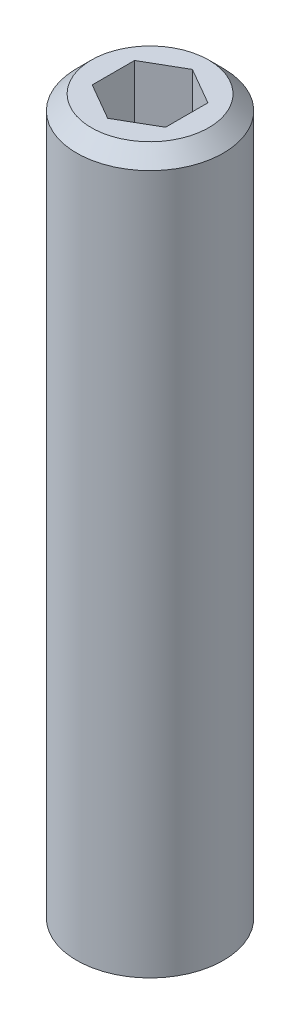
ISO-10303-21;
HEADER;
FILE_DESCRIPTION(('STEP AP214'),'2;1');
FILE_NAME('part.step','',(''),(''),'','','');
FILE_SCHEMA(('AUTOMOTIVE_DESIGN { 1 0 10303 214 1 1 1 1 }'));
ENDSEC;
DATA;
#1=APPLICATION_CONTEXT('core data for automotive mechanical design processes');
#2=APPLICATION_PROTOCOL_DEFINITION('international standard','automotive_design',2000,#1);
#3=PRODUCT_CONTEXT('',#1,'mechanical');
#4=PRODUCT('Part','Part','',(#3));
#5=PRODUCT_RELATED_PRODUCT_CATEGORY('part','',(#4));
#6=PRODUCT_DEFINITION_FORMATION('','',#4);
#7=PRODUCT_DEFINITION_CONTEXT('part definition',#1,'design');
#8=PRODUCT_DEFINITION('design','',#6,#7);
#9=PRODUCT_DEFINITION_SHAPE('','',#8);
#10=(LENGTH_UNIT() NAMED_UNIT(*) SI_UNIT(.MILLI.,.METRE.));
#11=(NAMED_UNIT(*) PLANE_ANGLE_UNIT() SI_UNIT($,.RADIAN.));
#12=(NAMED_UNIT(*) SI_UNIT($,.STERADIAN.) SOLID_ANGLE_UNIT());
#13=UNCERTAINTY_MEASURE_WITH_UNIT(LENGTH_MEASURE(1.E-05),#10,'distance_accuracy_value','');
#14=(GEOMETRIC_REPRESENTATION_CONTEXT(3) GLOBAL_UNCERTAINTY_ASSIGNED_CONTEXT((#13)) GLOBAL_UNIT_ASSIGNED_CONTEXT((#10,
#11,#12)) REPRESENTATION_CONTEXT('',''));
#15=CARTESIAN_POINT('',(0.,0.,0.));
#16=DIRECTION('',(0.,0.,1.));
#17=DIRECTION('',(1.,0.,0.));
#18=AXIS2_PLACEMENT_3D('',#15,#16,#17);
#19=CARTESIAN_POINT('',(0.,0.,0.));
#20=DIRECTION('',(0.,1.,0.));
#21=DIRECTION('',(0.,0.,1.));
#22=AXIS2_PLACEMENT_3D('',#19,#20,#21);
#23=CYLINDRICAL_SURFACE('',#22,2.);
#24=CARTESIAN_POINT('',(0.,-19.4651016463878,0.));
#25=DIRECTION('',(0.,-1.,0.));
#26=DIRECTION('',(0.,0.,-1.));
#27=AXIS2_PLACEMENT_3D('',#24,#25,#26);
#28=CIRCLE('',#27,2.);
#29=CARTESIAN_POINT('',(0.,-19.4651016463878,-2.));
#30=VERTEX_POINT('',#29);
#31=EDGE_CURVE('E471',#30,#30,#28,.T.);
#32=ORIENTED_EDGE('',*,*,#31,.F.);
#33=EDGE_LOOP('',(#32));
#34=FACE_BOUND('',#33,.T.);
#35=CARTESIAN_POINT('',(0.,-0.400000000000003,0.));
#36=DIRECTION('',(0.,-1.,0.));
#37=DIRECTION('',(0.,0.,-1.));
#38=AXIS2_PLACEMENT_3D('',#35,#36,#37);
#39=CIRCLE('',#38,2.);
#40=CARTESIAN_POINT('',(0.,-0.400000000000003,-2.));
#41=VERTEX_POINT('',#40);
#42=EDGE_CURVE('E11',#41,#41,#39,.T.);
#43=ORIENTED_EDGE('',*,*,#42,.T.);
#44=EDGE_LOOP('',(#43));
#45=FACE_BOUND('',#44,.T.);
#46=ADVANCED_FACE('F368',(#34,#45),#23,.T.);
#47=CARTESIAN_POINT('',(0.,0.,0.));
#48=DIRECTION('',(0.,-1.,0.));
#49=DIRECTION('',(0.,0.,-1.));
#50=AXIS2_PLACEMENT_3D('',#47,#48,#49);
#51=PLANE('',#50);
#52=DIRECTION('',(0.,0.,-1.));
#53=VECTOR('',#52,1.);
#54=CARTESIAN_POINT('',(1.,0.,0.577350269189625));
#55=LINE('',#54,#53);
#56=CARTESIAN_POINT('',(1.,0.,0.577350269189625));
#57=VERTEX_POINT('',#56);
#58=CARTESIAN_POINT('',(1.,0.,-0.577350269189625));
#59=VERTEX_POINT('',#58);
#60=EDGE_CURVE('E437',#57,#59,#55,.T.);
#61=ORIENTED_EDGE('',*,*,#60,.F.);
#62=DIRECTION('',(0.866025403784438,0.,-0.500000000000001));
#63=VECTOR('',#62,1.);
#64=CARTESIAN_POINT('',(0.,0.,1.15470053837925));
#65=LINE('',#64,#63);
#66=CARTESIAN_POINT('',(0.,0.,1.15470053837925));
#67=VERTEX_POINT('',#66);
#68=EDGE_CURVE('E383',#67,#57,#65,.T.);
#69=ORIENTED_EDGE('',*,*,#68,.F.);
#70=DIRECTION('',(0.866025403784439,0.,0.5));
#71=VECTOR('',#70,1.);
#72=CARTESIAN_POINT('',(-0.999999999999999,0.,0.577350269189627));
#73=LINE('',#72,#71);
#74=CARTESIAN_POINT('',(-0.999999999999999,0.,0.577350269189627));
#75=VERTEX_POINT('',#74);
#76=EDGE_CURVE('E453',#75,#67,#73,.T.);
#77=ORIENTED_EDGE('',*,*,#76,.F.);
#78=DIRECTION('',(0.,0.,1.));
#79=VECTOR('',#78,1.);
#80=CARTESIAN_POINT('',(-0.999999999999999,0.,-0.577350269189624));
#81=LINE('',#80,#79);
#82=CARTESIAN_POINT('',(-0.999999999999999,0.,-0.577350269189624));
#83=VERTEX_POINT('',#82);
#84=EDGE_CURVE('E447',#83,#75,#81,.T.);
#85=ORIENTED_EDGE('',*,*,#84,.F.);
#86=DIRECTION('',(-0.866025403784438,0.,0.500000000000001));
#87=VECTOR('',#86,1.);
#88=CARTESIAN_POINT('',(0.,0.,-1.15470053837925));
#89=LINE('',#88,#87);
#90=CARTESIAN_POINT('',(0.,0.,-1.15470053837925));
#91=VERTEX_POINT('',#90);
#92=EDGE_CURVE('E445',#91,#83,#89,.T.);
#93=ORIENTED_EDGE('',*,*,#92,.F.);
#94=DIRECTION('',(-0.866025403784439,0.,-0.5));
#95=VECTOR('',#94,1.);
#96=CARTESIAN_POINT('',(1.,0.,-0.577350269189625));
#97=LINE('',#96,#95);
#98=EDGE_CURVE('E426',#59,#91,#97,.T.);
#99=ORIENTED_EDGE('',*,*,#98,.F.);
#100=EDGE_LOOP('',(#61,#69,#77,#85,#93,#99));
#101=FACE_BOUND('',#100,.T.);
#102=CARTESIAN_POINT('',(0.,0.,0.));
#103=DIRECTION('',(0.,-1.,0.));
#104=DIRECTION('',(0.,0.,-1.));
#105=AXIS2_PLACEMENT_3D('',#102,#103,#104);
#106=CIRCLE('',#105,1.6);
#107=CARTESIAN_POINT('',(0.,0.,-1.6));
#108=VERTEX_POINT('',#107);
#109=EDGE_CURVE('E376',#108,#108,#106,.F.);
#110=ORIENTED_EDGE('',*,*,#109,.T.);
#111=EDGE_LOOP('',(#110));
#112=FACE_BOUND('',#111,.T.);
#113=ADVANCED_FACE('F441',(#101,#112),#51,.F.);
#114=CARTESIAN_POINT('',(0.,0.,0.));
#115=DIRECTION('',(0.,-1.,0.));
#116=DIRECTION('',(0.,0.,-1.));
#117=AXIS2_PLACEMENT_3D('',#114,#115,#116);
#118=CONICAL_SURFACE('',#117,1.6,0.785398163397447);
#119=CARTESIAN_POINT('',(0.,-0.400000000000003,-2.));
#120=CARTESIAN_POINT('',(0.,-0.395833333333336,-1.99583333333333));
#121=CARTESIAN_POINT('',(0.,-0.391666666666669,-1.99166666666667));
#122=CARTESIAN_POINT('',(0.,-0.383333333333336,-1.98333333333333));
#123=CARTESIAN_POINT('',(0.,-0.379166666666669,-1.97916666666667));
#124=CARTESIAN_POINT('',(0.,-0.370833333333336,-1.97083333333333));
#125=CARTESIAN_POINT('',(0.,-0.366666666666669,-1.96666666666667));
#126=CARTESIAN_POINT('',(0.,-0.358333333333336,-1.95833333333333));
#127=CARTESIAN_POINT('',(0.,-0.354166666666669,-1.95416666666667));
#128=CARTESIAN_POINT('',(0.,-0.345833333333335,-1.94583333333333));
#129=CARTESIAN_POINT('',(0.,-0.341666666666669,-1.94166666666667));
#130=CARTESIAN_POINT('',(0.,-0.333333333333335,-1.93333333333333));
#131=CARTESIAN_POINT('',(0.,-0.329166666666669,-1.92916666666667));
#132=CARTESIAN_POINT('',(0.,-0.320833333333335,-1.92083333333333));
#133=CARTESIAN_POINT('',(0.,-0.316666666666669,-1.91666666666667));
#134=CARTESIAN_POINT('',(0.,-0.308333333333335,-1.90833333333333));
#135=CARTESIAN_POINT('',(0.,-0.304166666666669,-1.90416666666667));
#136=CARTESIAN_POINT('',(0.,-0.295833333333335,-1.89583333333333));
#137=CARTESIAN_POINT('',(0.,-0.291666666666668,-1.89166666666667));
#138=CARTESIAN_POINT('',(0.,-0.283333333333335,-1.88333333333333));
#139=CARTESIAN_POINT('',(0.,-0.279166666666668,-1.87916666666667));
#140=CARTESIAN_POINT('',(0.,-0.270833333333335,-1.87083333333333));
#141=CARTESIAN_POINT('',(0.,-0.266666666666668,-1.86666666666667));
#142=CARTESIAN_POINT('',(0.,-0.258333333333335,-1.85833333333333));
#143=CARTESIAN_POINT('',(0.,-0.254166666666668,-1.85416666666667));
#144=CARTESIAN_POINT('',(0.,-0.245833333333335,-1.84583333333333));
#145=CARTESIAN_POINT('',(0.,-0.241666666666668,-1.84166666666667));
#146=CARTESIAN_POINT('',(0.,-0.233333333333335,-1.83333333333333));
#147=CARTESIAN_POINT('',(0.,-0.229166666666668,-1.82916666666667));
#148=CARTESIAN_POINT('',(0.,-0.220833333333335,-1.82083333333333));
#149=CARTESIAN_POINT('',(0.,-0.216666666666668,-1.81666666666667));
#150=CARTESIAN_POINT('',(0.,-0.208333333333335,-1.80833333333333));
#151=CARTESIAN_POINT('',(0.,-0.204166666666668,-1.80416666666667));
#152=CARTESIAN_POINT('',(0.,-0.195833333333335,-1.79583333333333));
#153=CARTESIAN_POINT('',(0.,-0.191666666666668,-1.79166666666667));
#154=CARTESIAN_POINT('',(0.,-0.183333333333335,-1.78333333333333));
#155=CARTESIAN_POINT('',(0.,-0.179166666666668,-1.77916666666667));
#156=CARTESIAN_POINT('',(0.,-0.170833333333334,-1.77083333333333));
#157=CARTESIAN_POINT('',(0.,-0.166666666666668,-1.76666666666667));
#158=CARTESIAN_POINT('',(0.,-0.158333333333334,-1.75833333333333));
#159=CARTESIAN_POINT('',(0.,-0.154166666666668,-1.75416666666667));
#160=CARTESIAN_POINT('',(0.,-0.145833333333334,-1.74583333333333));
#161=CARTESIAN_POINT('',(0.,-0.141666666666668,-1.74166666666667));
#162=CARTESIAN_POINT('',(0.,-0.133333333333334,-1.73333333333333));
#163=CARTESIAN_POINT('',(0.,-0.129166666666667,-1.72916666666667));
#164=CARTESIAN_POINT('',(0.,-0.120833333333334,-1.72083333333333));
#165=CARTESIAN_POINT('',(0.,-0.116666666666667,-1.71666666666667));
#166=CARTESIAN_POINT('',(0.,-0.108333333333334,-1.70833333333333));
#167=CARTESIAN_POINT('',(0.,-0.104166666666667,-1.70416666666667));
#168=CARTESIAN_POINT('',(0.,-0.0958333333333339,-1.69583333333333));
#169=CARTESIAN_POINT('',(0.,-0.0916666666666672,-1.69166666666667));
#170=CARTESIAN_POINT('',(0.,-0.0833333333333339,-1.68333333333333));
#171=CARTESIAN_POINT('',(0.,-0.0791666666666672,-1.67916666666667));
#172=CARTESIAN_POINT('',(0.,-0.0708333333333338,-1.67083333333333));
#173=CARTESIAN_POINT('',(0.,-0.066666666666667,-1.66666666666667));
#174=CARTESIAN_POINT('',(0.,-0.0583333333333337,-1.65833333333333));
#175=CARTESIAN_POINT('',(0.,-0.054166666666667,-1.65416666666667));
#176=CARTESIAN_POINT('',(0.,-0.0458333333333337,-1.64583333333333));
#177=CARTESIAN_POINT('',(0.,-0.0416666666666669,-1.64166666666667));
#178=CARTESIAN_POINT('',(0.,-0.0333333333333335,-1.63333333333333));
#179=CARTESIAN_POINT('',(0.,-0.0291666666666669,-1.62916666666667));
#180=CARTESIAN_POINT('',(0.,-0.0208333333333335,-1.62083333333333));
#181=CARTESIAN_POINT('',(0.,-0.0166666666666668,-1.61666666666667));
#182=CARTESIAN_POINT('',(0.,-0.00833333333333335,-1.60833333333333));
#183=CARTESIAN_POINT('',(0.,-0.00416666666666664,-1.60416666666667));
#184=CARTESIAN_POINT('',(0.,0.,-1.6));
#185=B_SPLINE_CURVE_WITH_KNOTS('',3,(#119,#120,#121,#122,#123,#124,#125,#126,#127,#128,#129,
#130,#131,#132,#133,#134,#135,#136,#137,#138,#139,#140,#141,#142,#143,#144,#145,#146,#147,#148,
#149,#150,#151,#152,#153,#154,#155,#156,#157,#158,#159,#160,#161,#162,#163,#164,#165,#166,#167,
#168,#169,#170,#171,#172,#173,#174,#175,#176,#177,#178,#179,#180,#181,#182,#183,#184),
.UNSPECIFIED.,.F.,.F.,(4,2,2,2,2,2,2,2,2,2,2,2,2,2,2,2,2,2,2,2,2,2,2,2,2,2,2,2,2,2,2,2,4),(0.,
0.0176776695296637,0.0353553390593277,0.0530330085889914,0.0707106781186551,0.0883883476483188,
0.106066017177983,0.123743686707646,0.14142135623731,0.159099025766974,0.176776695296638,
0.194454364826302,0.212132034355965,0.229809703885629,0.247487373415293,0.265165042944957,
0.282842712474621,0.300520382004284,0.318198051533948,0.335875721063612,0.353553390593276,
0.371231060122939,0.388908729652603,0.406586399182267,0.424264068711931,0.441941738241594,
0.459619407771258,0.477297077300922,0.494974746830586,0.512652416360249,0.530330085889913,
0.548007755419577,0.565685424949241),.UNSPECIFIED.);
#186=EDGE_CURVE('BSEAM485',#41,#108,#185,.T.);
#187=ORIENTED_EDGE('',*,*,#42,.F.);
#188=ORIENTED_EDGE('',*,*,#109,.F.);
#189=ORIENTED_EDGE('',*,*,#186,.T.);
#190=ORIENTED_EDGE('',*,*,#186,.F.);
#191=EDGE_LOOP('',(#187,#189,#188,#190));
#192=FACE_BOUND('',#191,.T.);
#193=ADVANCED_FACE('F485',(#192),#118,.T.);
#194=CARTESIAN_POINT('',(0.,-16.00100003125,0.));
#195=DIRECTION('',(0.,-1.,0.));
#196=DIRECTION('',(0.,0.,-1.));
#197=AXIS2_PLACEMENT_3D('',#194,#195,#196);
#198=SPHERICAL_SURFACE('',#197,4.);
#199=CARTESIAN_POINT('',(0.,-20.,0.));
#200=DIRECTION('',(0.,1.,0.));
#201=DIRECTION('',(0.,0.,1.));
#202=AXIS2_PLACEMENT_3D('',#199,#200,#201);
#203=CIRCLE('',#202,0.0894385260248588);
#204=CARTESIAN_POINT('',(0.,-20.,-0.0894385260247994));
#205=VERTEX_POINT('',#204);
#206=EDGE_CURVE('E480',#205,#205,#203,.F.);
#207=CARTESIAN_POINT('',(0.,-19.4651016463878,-2.));
#208=CARTESIAN_POINT('',(0.,-19.4755441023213,-1.98191316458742));
#209=CARTESIAN_POINT('',(0.,-19.4858448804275,-1.96374453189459));
#210=CARTESIAN_POINT('',(0.,-19.506160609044,-1.92724816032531));
#211=CARTESIAN_POINT('',(0.,-19.5161755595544,-1.90892042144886));
#212=CARTESIAN_POINT('',(0.,-19.5359171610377,-1.87211032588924));
#213=CARTESIAN_POINT('',(0.,-19.5456438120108,-1.85362796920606));
#214=CARTESIAN_POINT('',(0.,-19.5648064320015,-1.8165131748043));
#215=CARTESIAN_POINT('',(0.,-19.5742424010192,-1.79788073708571));
#216=CARTESIAN_POINT('',(0.,-19.5928213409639,-1.76047035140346));
#217=CARTESIAN_POINT('',(0.,-19.6019643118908,-1.74169240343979));
#218=CARTESIAN_POINT('',(0.,-19.6199550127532,-1.70399560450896));
#219=CARTESIAN_POINT('',(0.,-19.6288027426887,-1.6850767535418));
#220=CARTESIAN_POINT('',(0.,-19.6462007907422,-1.64710279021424));
#221=CARTESIAN_POINT('',(0.,-19.6547511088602,-1.62804767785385));
#222=CARTESIAN_POINT('',(0.,-19.6715522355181,-1.58980586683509));
#223=CARTESIAN_POINT('',(0.,-19.6798030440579,-1.57061916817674));
#224=CARTESIAN_POINT('',(0.,-19.6960031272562,-1.53211889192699));
#225=CARTESIAN_POINT('',(0.,-19.7039524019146,-1.51280531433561));
#226=CARTESIAN_POINT('',(0.,-19.7195474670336,-1.47405601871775));
#227=CARTESIAN_POINT('',(0.,-19.7271932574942,-1.45462030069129));
#228=CARTESIAN_POINT('',(0.,-19.7421794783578,-1.41563149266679));
#229=CARTESIAN_POINT('',(0.,-19.7495199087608,-1.39607840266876));
#230=CARTESIAN_POINT('',(0.,-19.7638936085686,-1.35685964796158));
#231=CARTESIAN_POINT('',(0.,-19.7709268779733,-1.33719398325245));
#232=CARTESIAN_POINT('',(0.,-19.7846845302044,-1.29775490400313));
#233=CARTESIAN_POINT('',(0.,-19.7914089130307,-1.27798148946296));
#234=CARTESIAN_POINT('',(0.,-19.8045471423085,-1.23833176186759));
#235=CARTESIAN_POINT('',(0.,-19.8109609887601,-1.2184554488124));
#236=CARTESIAN_POINT('',(0.,-19.8234765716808,-1.17860480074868));
#237=CARTESIAN_POINT('',(0.,-19.82957830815,-1.15863046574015));
#238=CARTESIAN_POINT('',(0.,-19.8414681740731,-1.11858867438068));
#239=CARTESIAN_POINT('',(0.,-19.847256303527,-1.09852121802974));
#240=CARTESIAN_POINT('',(0.,-19.8585175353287,-1.05829810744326));
#241=CARTESIAN_POINT('',(0.,-19.8639906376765,-1.03814245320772));
#242=CARTESIAN_POINT('',(0.,-19.8746204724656,-0.997747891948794));
#243=CARTESIAN_POINT('',(0.,-19.8797772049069,-0.97750898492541));
#244=CARTESIAN_POINT('',(0.,-19.8897730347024,-0.936952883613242));
#245=CARTESIAN_POINT('',(0.,-19.8946121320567,-0.916635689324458));
#246=CARTESIAN_POINT('',(0.,-19.903971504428,-0.875927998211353));
#247=CARTESIAN_POINT('',(0.,-19.908491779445,-0.855537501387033));
#248=CARTESIAN_POINT('',(0.,-19.9172123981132,-0.814688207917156));
#249=CARTESIAN_POINT('',(0.,-19.9214127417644,-0.794229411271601));
#250=CARTESIAN_POINT('',(0.,-19.929492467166,-0.753248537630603));
#251=CARTESIAN_POINT('',(0.,-19.9333718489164,-0.732726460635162));
#252=CARTESIAN_POINT('',(0.,-19.940808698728,-0.691624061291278));
#253=CARTESIAN_POINT('',(0.,-19.9443661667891,-0.671043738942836));
#254=CARTESIAN_POINT('',(0.,-19.9511583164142,-0.629829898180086));
#255=CARTESIAN_POINT('',(0.,-19.9543929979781,-0.609196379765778));
#256=CARTESIAN_POINT('',(0.,-19.9605387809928,-0.567881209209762));
#257=CARTESIAN_POINT('',(0.,-19.9634498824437,-0.547199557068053));
#258=CARTESIAN_POINT('',(0.,-19.9689477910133,-0.505793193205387));
#259=CARTESIAN_POINT('',(0.,-19.971534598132,-0.485068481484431));
#260=CARTESIAN_POINT('',(0.,-19.9763832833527,-0.443581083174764));
#261=CARTESIAN_POINT('',(0.,-19.9786451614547,-0.422818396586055));
#262=CARTESIAN_POINT('',(0.,-19.982843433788,-0.381260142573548));
#263=CARTESIAN_POINT('',(0.,-19.9847798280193,-0.360464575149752));
#264=CARTESIAN_POINT('',(0.,-19.9883266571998,-0.318845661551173));
#265=CARTESIAN_POINT('',(0.,-19.9899370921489,-0.29802231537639));
#266=CARTESIAN_POINT('',(0.,-19.9928316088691,-0.256352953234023));
#267=CARTESIAN_POINT('',(0.,-19.9941156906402,-0.23550693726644));
#268=CARTESIAN_POINT('',(0.,-19.9963571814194,-0.193797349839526));
#269=CARTESIAN_POINT('',(0.,-19.9973145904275,-0.172933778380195));
#270=CARTESIAN_POINT('',(0.,-19.9989025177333,-0.131194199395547));
#271=CARTESIAN_POINT('',(0.,-19.9995330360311,-0.11031819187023));
#272=CARTESIAN_POINT('',(0.,-20.,-0.0894385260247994));
#273=B_SPLINE_CURVE_WITH_KNOTS('',3,(#207,#208,#209,#210,#211,#212,#213,#214,#215,#216,#217,
#218,#219,#220,#221,#222,#223,#224,#225,#226,#227,#228,#229,#230,#231,#232,#233,#234,#235,#236,
#237,#238,#239,#240,#241,#242,#243,#244,#245,#246,#247,#248,#249,#250,#251,#252,#253,#254,#255,
#256,#257,#258,#259,#260,#261,#262,#263,#264,#265,#266,#267,#268,#269,#270,#271,#272),
.UNSPECIFIED.,.F.,.F.,(4,2,2,2,2,2,2,2,2,2,2,2,2,2,2,2,2,2,2,2,2,2,2,2,2,2,2,2,2,2,2,2,4),(0.,
0.0626540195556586,0.125308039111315,0.187962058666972,0.25061607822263,0.313270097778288,
0.375924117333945,0.438578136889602,0.50123215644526,0.563886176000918,0.626540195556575,
0.689194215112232,0.75184823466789,0.814502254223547,0.877156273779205,0.939810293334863,
1.00246431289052,1.06511833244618,1.12777235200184,1.19042637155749,1.25308039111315,
1.31573441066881,1.37838843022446,1.44104244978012,1.50369646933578,1.56635048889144,
1.62900450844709,1.69165852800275,1.75431254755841,1.81696656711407,1.87962058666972,
1.94227460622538,2.00492862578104),.UNSPECIFIED.);
#274=EDGE_CURVE('BSEAM487',#30,#205,#273,.T.);
#275=ORIENTED_EDGE('',*,*,#31,.T.);
#276=ORIENTED_EDGE('',*,*,#206,.F.);
#277=ORIENTED_EDGE('',*,*,#274,.T.);
#278=ORIENTED_EDGE('',*,*,#274,.F.);
#279=EDGE_LOOP('',(#275,#277,#276,#278));
#280=FACE_BOUND('',#279,.T.);
#281=ADVANCED_FACE('F487',(#280),#198,.T.);
#282=CARTESIAN_POINT('',(0.,-20.,0.));
#283=DIRECTION('',(0.,1.,0.));
#284=DIRECTION('',(0.,0.,1.));
#285=AXIS2_PLACEMENT_3D('',#282,#283,#284);
#286=PLANE('',#285);
#287=ORIENTED_EDGE('',*,*,#206,.T.);
#288=EDGE_LOOP('',(#287));
#289=FACE_BOUND('',#288,.T.);
#290=ADVANCED_FACE('F370',(#289),#286,.F.);
#291=CARTESIAN_POINT('',(0.,-3.,1.15470053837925));
#292=DIRECTION('',(0.500000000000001,0.,0.866025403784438));
#293=DIRECTION('',(0.866025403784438,0.,-0.500000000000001));
#294=AXIS2_PLACEMENT_3D('',#291,#292,#293);
#295=PLANE('',#294);
#296=ORIENTED_EDGE('',*,*,#68,.T.);
#297=DIRECTION('',(0.,1.,0.));
#298=VECTOR('',#297,1.);
#299=CARTESIAN_POINT('',(1.,-3.,0.577350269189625));
#300=LINE('',#299,#298);
#301=CARTESIAN_POINT('',(1.,-3.,0.577350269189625));
#302=VERTEX_POINT('',#301);
#303=EDGE_CURVE('E434',#302,#57,#300,.T.);
#304=ORIENTED_EDGE('',*,*,#303,.F.);
#305=DIRECTION('',(0.866025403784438,0.,-0.500000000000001));
#306=VECTOR('',#305,1.);
#307=CARTESIAN_POINT('',(0.,-3.,1.15470053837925));
#308=LINE('',#307,#306);
#309=CARTESIAN_POINT('',(0.,-3.,1.15470053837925));
#310=VERTEX_POINT('',#309);
#311=EDGE_CURVE('E455',#310,#302,#308,.T.);
#312=ORIENTED_EDGE('',*,*,#311,.F.);
#313=DIRECTION('',(0.,1.,0.));
#314=VECTOR('',#313,1.);
#315=CARTESIAN_POINT('',(0.,-3.,1.15470053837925));
#316=LINE('',#315,#314);
#317=EDGE_CURVE('E390',#310,#67,#316,.T.);
#318=ORIENTED_EDGE('',*,*,#317,.T.);
#319=EDGE_LOOP('',(#296,#304,#312,#318));
#320=FACE_BOUND('',#319,.T.);
#321=ADVANCED_FACE('F508',(#320),#295,.F.);
#322=CARTESIAN_POINT('',(-0.999999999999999,-3.,0.577350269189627));
#323=DIRECTION('',(-0.5,0.,0.866025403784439));
#324=DIRECTION('',(0.866025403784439,0.,0.5));
#325=AXIS2_PLACEMENT_3D('',#322,#323,#324);
#326=PLANE('',#325);
#327=ORIENTED_EDGE('',*,*,#76,.T.);
#328=ORIENTED_EDGE('',*,*,#317,.F.);
#329=DIRECTION('',(0.866025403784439,0.,0.5));
#330=VECTOR('',#329,1.);
#331=CARTESIAN_POINT('',(-0.999999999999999,-3.,0.577350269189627));
#332=LINE('',#331,#330);
#333=CARTESIAN_POINT('',(-0.999999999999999,-3.,0.577350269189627));
#334=VERTEX_POINT('',#333);
#335=EDGE_CURVE('E467',#334,#310,#332,.T.);
#336=ORIENTED_EDGE('',*,*,#335,.F.);
#337=DIRECTION('',(0.,1.,0.));
#338=VECTOR('',#337,1.);
#339=CARTESIAN_POINT('',(-0.999999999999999,-3.,0.577350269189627));
#340=LINE('',#339,#338);
#341=EDGE_CURVE('E472',#334,#75,#340,.T.);
#342=ORIENTED_EDGE('',*,*,#341,.T.);
#343=EDGE_LOOP('',(#327,#328,#336,#342));
#344=FACE_BOUND('',#343,.T.);
#345=ADVANCED_FACE('F512',(#344),#326,.F.);
#346=CARTESIAN_POINT('',(-0.999999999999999,-3.,-0.577350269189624));
#347=DIRECTION('',(-1.,0.,0.));
#348=DIRECTION('',(0.,0.,1.));
#349=AXIS2_PLACEMENT_3D('',#346,#347,#348);
#350=PLANE('',#349);
#351=ORIENTED_EDGE('',*,*,#84,.T.);
#352=ORIENTED_EDGE('',*,*,#341,.F.);
#353=DIRECTION('',(0.,0.,1.));
#354=VECTOR('',#353,1.);
#355=CARTESIAN_POINT('',(-0.999999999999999,-3.,-0.577350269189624));
#356=LINE('',#355,#354);
#357=CARTESIAN_POINT('',(-0.999999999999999,-3.,-0.577350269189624));
#358=VERTEX_POINT('',#357);
#359=EDGE_CURVE('E464',#358,#334,#356,.T.);
#360=ORIENTED_EDGE('',*,*,#359,.F.);
#361=DIRECTION('',(0.,1.,0.));
#362=VECTOR('',#361,1.);
#363=CARTESIAN_POINT('',(-0.999999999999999,-3.,-0.577350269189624));
#364=LINE('',#363,#362);
#365=EDGE_CURVE('E474',#358,#83,#364,.T.);
#366=ORIENTED_EDGE('',*,*,#365,.T.);
#367=EDGE_LOOP('',(#351,#352,#360,#366));
#368=FACE_BOUND('',#367,.T.);
#369=ADVANCED_FACE('F517',(#368),#350,.F.);
#370=CARTESIAN_POINT('',(0.,-3.,-1.15470053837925));
#371=DIRECTION('',(-0.500000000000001,0.,-0.866025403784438));
#372=DIRECTION('',(-0.866025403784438,0.,0.500000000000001));
#373=AXIS2_PLACEMENT_3D('',#370,#371,#372);
#374=PLANE('',#373);
#375=ORIENTED_EDGE('',*,*,#92,.T.);
#376=ORIENTED_EDGE('',*,*,#365,.F.);
#377=DIRECTION('',(-0.866025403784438,0.,0.500000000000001));
#378=VECTOR('',#377,1.);
#379=CARTESIAN_POINT('',(0.,-3.,-1.15470053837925));
#380=LINE('',#379,#378);
#381=CARTESIAN_POINT('',(0.,-3.,-1.15470053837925));
#382=VERTEX_POINT('',#381);
#383=EDGE_CURVE('E461',#382,#358,#380,.T.);
#384=ORIENTED_EDGE('',*,*,#383,.F.);
#385=DIRECTION('',(0.,1.,0.));
#386=VECTOR('',#385,1.);
#387=CARTESIAN_POINT('',(0.,-3.,-1.15470053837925));
#388=LINE('',#387,#386);
#389=EDGE_CURVE('E433',#382,#91,#388,.T.);
#390=ORIENTED_EDGE('',*,*,#389,.T.);
#391=EDGE_LOOP('',(#375,#376,#384,#390));
#392=FACE_BOUND('',#391,.T.);
#393=ADVANCED_FACE('F525',(#392),#374,.F.);
#394=CARTESIAN_POINT('',(1.,-3.,-0.577350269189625));
#395=DIRECTION('',(0.5,0.,-0.866025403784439));
#396=DIRECTION('',(-0.866025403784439,0.,-0.5));
#397=AXIS2_PLACEMENT_3D('',#394,#395,#396);
#398=PLANE('',#397);
#399=ORIENTED_EDGE('',*,*,#98,.T.);
#400=ORIENTED_EDGE('',*,*,#389,.F.);
#401=DIRECTION('',(-0.866025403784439,0.,-0.5));
#402=VECTOR('',#401,1.);
#403=CARTESIAN_POINT('',(1.,-3.,-0.577350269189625));
#404=LINE('',#403,#402);
#405=CARTESIAN_POINT('',(1.,-3.,-0.577350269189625));
#406=VERTEX_POINT('',#405);
#407=EDGE_CURVE('E429',#406,#382,#404,.T.);
#408=ORIENTED_EDGE('',*,*,#407,.F.);
#409=DIRECTION('',(0.,1.,0.));
#410=VECTOR('',#409,1.);
#411=CARTESIAN_POINT('',(1.,-3.,-0.577350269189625));
#412=LINE('',#411,#410);
#413=EDGE_CURVE('E422',#406,#59,#412,.T.);
#414=ORIENTED_EDGE('',*,*,#413,.T.);
#415=EDGE_LOOP('',(#399,#400,#408,#414));
#416=FACE_BOUND('',#415,.T.);
#417=ADVANCED_FACE('F424',(#416),#398,.F.);
#418=CARTESIAN_POINT('',(1.,-3.,0.577350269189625));
#419=DIRECTION('',(1.,0.,0.));
#420=DIRECTION('',(0.,0.,-1.));
#421=AXIS2_PLACEMENT_3D('',#418,#419,#420);
#422=PLANE('',#421);
#423=ORIENTED_EDGE('',*,*,#60,.T.);
#424=ORIENTED_EDGE('',*,*,#413,.F.);
#425=DIRECTION('',(0.,0.,-1.));
#426=VECTOR('',#425,1.);
#427=CARTESIAN_POINT('',(1.,-3.,0.577350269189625));
#428=LINE('',#427,#426);
#429=EDGE_CURVE('E458',#302,#406,#428,.T.);
#430=ORIENTED_EDGE('',*,*,#429,.F.);
#431=ORIENTED_EDGE('',*,*,#303,.T.);
#432=EDGE_LOOP('',(#423,#424,#430,#431));
#433=FACE_BOUND('',#432,.T.);
#434=ADVANCED_FACE('F438',(#433),#422,.F.);
#435=CARTESIAN_POINT('',(2.,-3.,0.));
#436=DIRECTION('',(0.,1.,0.));
#437=DIRECTION('',(0.,0.,1.));
#438=AXIS2_PLACEMENT_3D('',#435,#436,#437);
#439=PLANE('',#438);
#440=ORIENTED_EDGE('',*,*,#311,.T.);
#441=ORIENTED_EDGE('',*,*,#429,.T.);
#442=ORIENTED_EDGE('',*,*,#407,.T.);
#443=ORIENTED_EDGE('',*,*,#383,.T.);
#444=ORIENTED_EDGE('',*,*,#359,.T.);
#445=ORIENTED_EDGE('',*,*,#335,.T.);
#446=EDGE_LOOP('',(#440,#441,#442,#443,#444,#445));
#447=FACE_BOUND('',#446,.T.);
#448=ADVANCED_FACE('F522',(#447),#439,.T.);
#449=CLOSED_SHELL('',(#46,#113,#193,#281,#290,#321,#345,#369,#393,#417,#434,#448));
#450=MANIFOLD_SOLID_BREP('B2',#449);
#451=ADVANCED_BREP_SHAPE_REPRESENTATION('',(#18,#450),#14);
#452=SHAPE_DEFINITION_REPRESENTATION(#9,#451);
ENDSEC;
END-ISO-10303-21;
